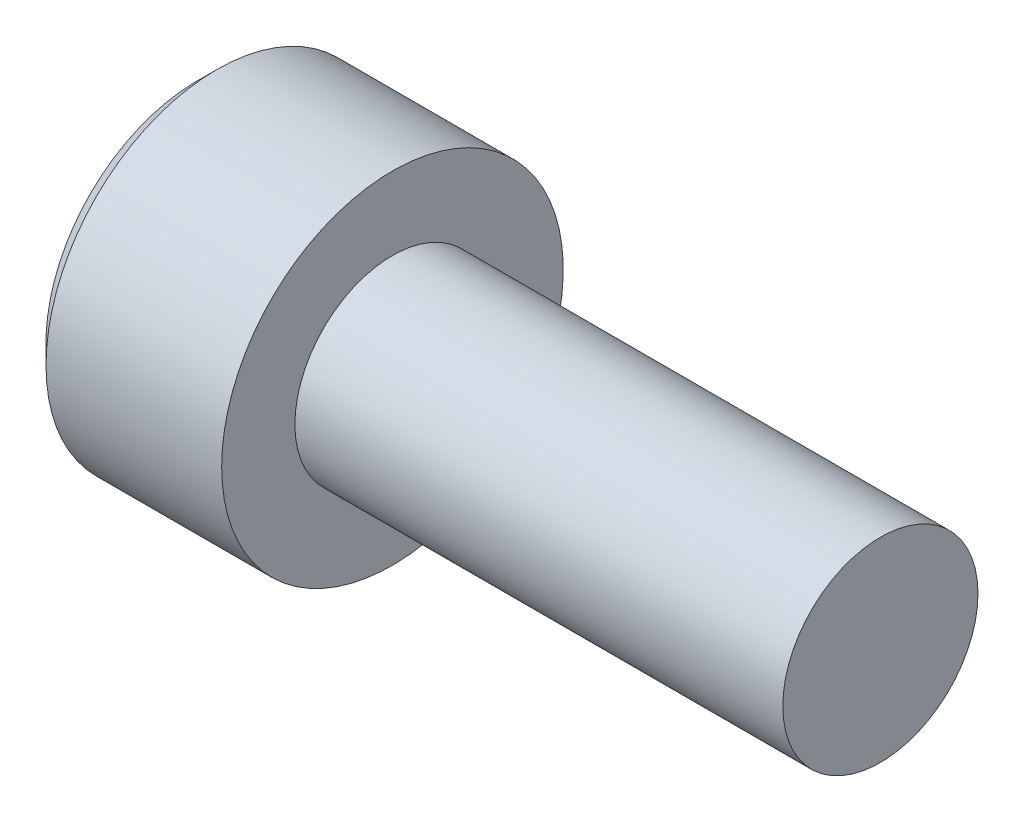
from build123d import *

# Parameters (mm, degrees)
CHAMFER1_SIZE      = 0.4
CUT_EXTRUDE1_DEPTH = 2


with BuildPart() as part:
    # Sketch1 → Revolve1 (revolve)
    with BuildSketch(Plane.XY, mode=Mode.PRIVATE) as revolve1_sk:
        Polygon((-4, 0), (10, 0), (10, 2), (0, 2), (0, 3.5), (-4, 3.5), align=None)
    revolve(revolve1_sk.sketch.rotate(Axis((-4, 0, 0), (1, 0, 0)), 90), axis=Axis((-4, 0, 0), (1, 0, 0)))

    # Chamfer1
    chamfer1_edges = [part.edges().sort_by_distance(p)[0] for p in [
        (-4, 0, -3.5),
    ]]
    chamfer(chamfer1_edges, length=CHAMFER1_SIZE)

    # Sketch2 → Cut-Revolve1 (revolve, cut)
    with BuildSketch(Plane.XY, mode=Mode.PRIVATE) as cut_revolve1_sk:
        Polygon((-1.098709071, 0), (-2, 1.5), (-4, 1.5), (-4, 0), align=None)
    revolve(cut_revolve1_sk.sketch.rotate(Axis((-4, 0, 0), (1, 0, 0)), 180), axis=Axis((-4, 0, 0), (1, 0, 0)), mode=Mode.SUBTRACT)

    # Sketch3 → Cut-Extrude1 (cut)
    with BuildSketch(Plane.ZY.offset(4)):
        Polygon((0, -1.732050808), (1.5, -0.866025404), (1.5, 0.866025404), (0, 1.732050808), (-1.5, 0.866025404), (-1.5, -0.866025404), align=None)
    extrude(amount=-CUT_EXTRUDE1_DEPTH, mode=Mode.SUBTRACT)


solid = part.part
